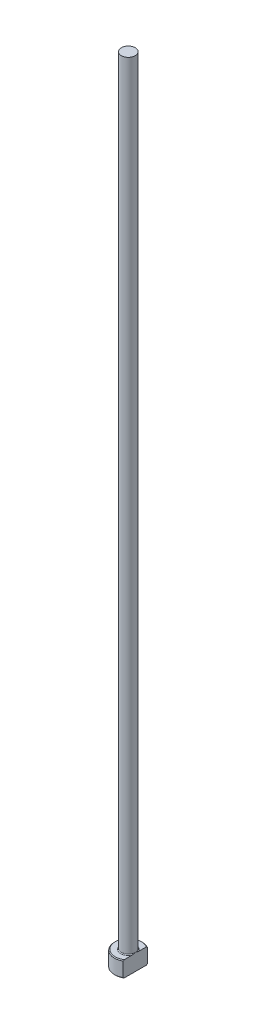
from build123d import *
from build123d.topology import SkipClean

# Parameters (mm, degrees)
CHAMFER1_SIZE    = 0.2
FILLET1_R        = 0.2
KEYED_HEAD_DEPTH = 201.061240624


with BuildPart() as part:
    # Sketch1 → Revolve1 (revolve)
    with BuildSketch(Plane.XY, mode=Mode.PRIVATE) as revolve1_sk:
        Polygon((0, 0), (-3.5, 0), (-3.5, 4), (-1.75, 4), (-1.75, 200), (0, 200), align=None)
    revolve(revolve1_sk.sketch.rotate(Axis((0, 259.958771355, 0), (0, -1, 0)), 270), axis=Axis((0, 259.958771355, 0), (0, -1, 0)))

    # Chamfer1
    chamfer1_edges = [part.edges().sort_by_distance(p)[0] for p in [
        (0, 4, -3.5),
        (0, 0, -3.5),
    ]]
    chamfer(chamfer1_edges, length=CHAMFER1_SIZE)

    # Fillet1
    fillet1_edges = [part.edges().sort_by_distance(p)[0] for p in [
        (0, 4, -1.75),
    ]]
    fillet(fillet1_edges, radius=FILLET1_R)

    # Sketch2 → KEYED HEAD (cut, through all)
    with SkipClean():  # the faces are left unmerged after this step: merging them gives an invalid solid
        with BuildSketch(Plane(origin=(0, 0, 0), x_dir=(1, 0, 0), z_dir=(0, 1, 0))):
            with BuildLine():
                Line((1.75, -3.031088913), (1.75, 3.031088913))
                ThreePointArc((1.75, 3.031088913), (3.5, 0), (1.75, -3.031088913))
            make_face()
        extrude(amount=KEYED_HEAD_DEPTH, mode=Mode.SUBTRACT)


solid = part.part
